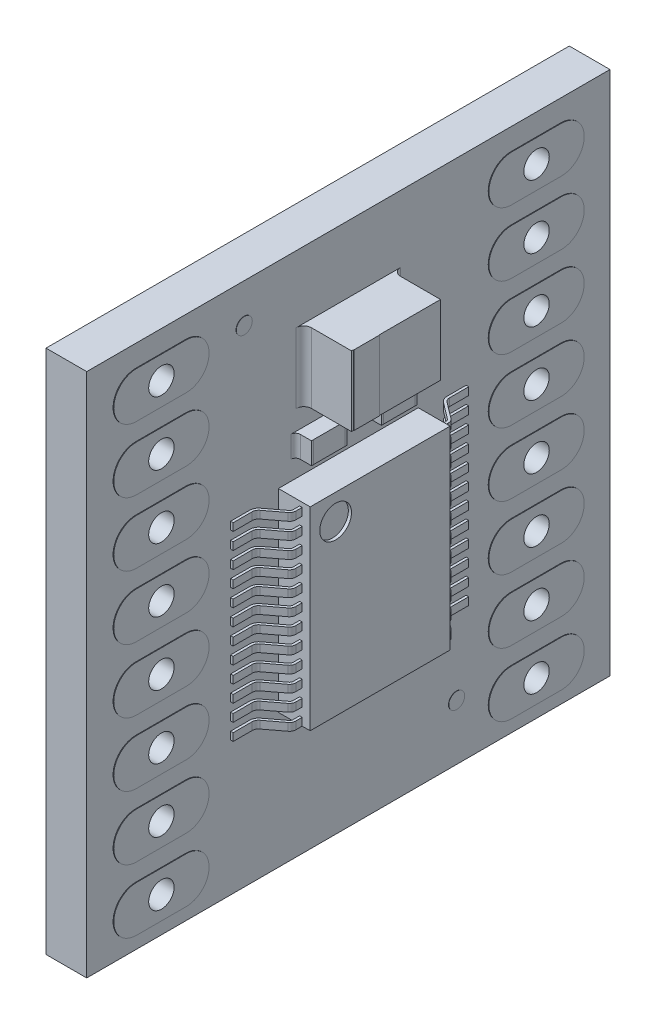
from build123d import *

# Parameters (mm, degrees)
SKETCH1_W            = 20.9042
SKETCH1_H            = 20.9804
BOSS_EXTRUDE1_DEPTH  = 1.6256
SKETCH2_W            = 5.588
SKETCH2_H            = 7.747
BOSS_EXTRUDE2_DEPTH  = 1.27
SKETCH7_R            = 0.635
CUT_EXTRUDE2_DEPTH   = 0.127
SKETCH4_R            = 0.508
CUT_EXTRUDE1_DEPTH   = 15.897424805
BOSS_EXTRUDE3_START  = 0.0254
SKETCH5_R            = 0.508
BOSS_EXTRUDE3_DEPTH  = 0.0254
SKETCH6_R            = 0.508
BOSS_EXTRUDE4_DEPTH  = 0.0254
LPATTERN1_COUNT      = 8
LPATTERN1_PITCH      = 2.54
SKETCH11_R           = 0.3175
BOSS_EXTRUDE8_DEPTH  = 0.0127
SKETCH9_W            = 1.27
SKETCH9_H            = 0.8636
BOSS_EXTRUDE6_DEPTH  = 0.635
SKETCH10_W           = 0.0762
SKETCH10_H           = 0.8636
BOSS_EXTRUDE7_DEPTH  = 0.63627
FILLET1_R            = 0.1905
SKETCH12_W           = 3.556
SKETCH12_H           = 2.794
BOSS_EXTRUDE9_DEPTH  = 1.905
FILLET2_R            = 0.3048
SKETCH13_W           = 1.016
SKETCH13_H           = 2.794
BOSS_EXTRUDE10_DEPTH = 0.0127
BOSS_EXTRUDE11_DEPTH = 0.3048
LPATTERN2_COUNT      = 12
LPATTERN2_PITCH      = 0.6604


with BuildPart() as part:
    # Sketch1 → Boss-Extrude1 (new body)
    with BuildSketch(Plane(origin=(0, 0, 0), x_dir=(0, 0, -1), z_dir=(1, 0, 0))):
        Rectangle(SKETCH1_W, SKETCH1_H)
    extrude(amount=BOSS_EXTRUDE1_DEPTH)

    # Sketch2 → Boss-Extrude2 (add)
    with BuildSketch(Plane(origin=(1.6256, 0, 0), x_dir=(0, 0, -1), z_dir=(1, 0, 0))):
        with Locations((0, -1.2573)):
            Rectangle(SKETCH2_W, SKETCH2_H)
    extrude(amount=BOSS_EXTRUDE2_DEPTH)

    # Sketch7 → Cut-Extrude2 (cut)
    with BuildSketch(Plane(origin=(2.8956, 0, 0), x_dir=(0, 0, -1), z_dir=(1, 0, 0))):
        with Locations((-1.778, 1.6002)):
            Circle(SKETCH7_R)
    extrude(amount=-CUT_EXTRUDE2_DEPTH, mode=Mode.SUBTRACT)

    # Sketch4 → Cut-Extrude1 (cut, through all)
    with BuildSketch(Plane(origin=(1.6256, 0, 0), x_dir=(0, 0, -1), z_dir=(1, 0, 0))):
        with Locations((-7.493, 8.7122)):
            Circle(SKETCH4_R)
        with Locations((7.493, 8.7122)):
            Circle(SKETCH4_R)
    cut_extrude1 = extrude(amount=-CUT_EXTRUDE1_DEPTH, mode=Mode.SUBTRACT)

    # Sketch5 → Boss-Extrude3 (add)
    # profile 1 of 2: a face of its own
    with BuildSketch(Plane(origin=(1.6256, 0, 0), x_dir=(0, 0, -1), z_dir=(1, 0, 0)).offset(BOSS_EXTRUDE3_START)):
        with BuildLine():
            Line((-8.4836, 9.6266), (-6.5024, 9.6266))
            ThreePointArc((-6.5024, 9.6266), (-5.588, 8.7122), (-6.5024, 7.7978))
            Line((-6.5024, 7.7978), (-8.4836, 7.7978))
            ThreePointArc((-8.4836, 7.7978), (-9.398, 8.7122), (-8.4836, 9.6266))
        make_face()
        with Locations((-7.493, 8.7122)):
            Circle(SKETCH5_R, mode=Mode.SUBTRACT)
    # profile 2 of 2: a face of its own
    with BuildSketch(Plane(origin=(1.6256, 0, 0), x_dir=(0, 0, -1), z_dir=(1, 0, 0)).offset(BOSS_EXTRUDE3_START)):
        with BuildLine():
            Line((6.5024, 9.6266), (8.4836, 9.6266))
            ThreePointArc((8.4836, 9.6266), (9.398, 8.7122), (8.4836, 7.7978))
            Line((8.4836, 7.7978), (6.5024, 7.7978))
            ThreePointArc((6.5024, 7.7978), (5.588, 8.7122), (6.5024, 9.6266))
        make_face()
        with Locations((7.493, 8.7122)):
            Circle(SKETCH5_R, mode=Mode.SUBTRACT)
    boss_extrude3 = extrude(amount=-BOSS_EXTRUDE3_DEPTH)

    # Sketch6 → Boss-Extrude4 (add)
    # profile 1 of 2: a face of its own
    with BuildSketch(Plane.ZY):
        with BuildLine():
            Line((-6.5024, 7.7978), (-8.4836, 7.7978))
            ThreePointArc((-8.4836, 7.7978), (-9.398, 8.7122), (-8.4836, 9.6266))
            Line((-8.4836, 9.6266), (-6.5024, 9.6266))
            ThreePointArc((-6.5024, 9.6266), (-5.588, 8.7122), (-6.5024, 7.7978))
        make_face()
        with Locations(Location((-7.493, 8.7122, 0), (0, 0, 180))):
            Circle(SKETCH6_R, mode=Mode.SUBTRACT)
    # profile 2 of 2: a face of its own
    with BuildSketch(Plane.ZY):
        with BuildLine():
            Line((8.4836, 7.7978), (6.5024, 7.7978))
            ThreePointArc((6.5024, 7.7978), (5.588, 8.7122), (6.5024, 9.6266))
            Line((6.5024, 9.6266), (8.4836, 9.6266))
            ThreePointArc((8.4836, 9.6266), (9.398, 8.7122), (8.4836, 7.7978))
        make_face()
        with Locations(Location((7.493, 8.7122, 0), (0, 0, 180))):
            Circle(SKETCH6_R, mode=Mode.SUBTRACT)
    boss_extrude4 = extrude(amount=BOSS_EXTRUDE4_DEPTH)

    # LPattern1: Cut-Extrude1, Boss-Extrude3, Boss-Extrude4 ×8
    with Locations(*[(0, -i * LPATTERN1_PITCH, 0) for i in range(1, LPATTERN1_COUNT)]):
        add(cut_extrude1, mode=Mode.SUBTRACT)
        add(boss_extrude3)
        add(boss_extrude4)

    # Sketch11 → Boss-Extrude8 (add)
    with BuildSketch(Plane(origin=(1.6256, 0, 0), x_dir=(0, 0, -1), z_dir=(1, 0, 0))):
        with Locations((-4.168295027, 8.945348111)):
            Circle(SKETCH11_R)
        with Locations((4.318468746, -8.263464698)):
            Circle(SKETCH11_R)
    extrude(amount=BOSS_EXTRUDE8_DEPTH)

    # Sketch9 → Boss-Extrude6 (add)
    with BuildSketch(Plane(origin=(1.6256, 0, 0), x_dir=(0, 0, -1), z_dir=(1, 0, 0))):
        with Locations((-1.397, 3.81)):
            Rectangle(SKETCH9_W, SKETCH9_H)
        with Locations((1.397, 3.81)):
            Rectangle(SKETCH9_W, SKETCH9_H)
    extrude(amount=BOSS_EXTRUDE6_DEPTH)

    # Sketch10 → Boss-Extrude7 (add)
    with BuildSketch(Plane(origin=(1.6256, 0, 0), x_dir=(0, 0, -1), z_dir=(1, 0, 0))):
        with Locations((-0.7239, 3.81)):
            Rectangle(SKETCH10_W, SKETCH10_H)
        with Locations((-2.0701, 3.81)):
            Rectangle(SKETCH10_W, SKETCH10_H)
        with Locations((0.7239, 3.81)):
            Rectangle(SKETCH10_W, SKETCH10_H)
        with Locations((2.0701, 3.81)):
            Rectangle(SKETCH10_W, SKETCH10_H)
    extrude(amount=BOSS_EXTRUDE7_DEPTH)

    # Fillet1
    fillet1_edges = [part.edges().sort_by_distance(p)[0] for p in [
        (1.6256, 3.81, 0.6858),
        (1.6256, 3.81, 2.1082),
        (1.6256, 3.81, -0.6858),
        (1.6256, 3.81, -2.1082),
    ]]
    fillet(fillet1_edges, radius=FILLET1_R)

    # Sketch12 → Boss-Extrude9 (add)
    with BuildSketch(Plane(origin=(1.6256, 0, 0), x_dir=(0, 0, -1), z_dir=(1, 0, 0))):
        with Locations((0, 6.4262)):
            Rectangle(SKETCH12_W, SKETCH12_H)
    extrude(amount=BOSS_EXTRUDE9_DEPTH)

    # Fillet2
    fillet2_edges = [part.edges().sort_by_distance(p)[0] for p in [
        (1.6256, 6.4262, -1.778),
        (1.6256, 6.4262, 1.778),
    ]]
    fillet(fillet2_edges, radius=FILLET2_R)

    # Sketch13 → Boss-Extrude10 (add)
    with BuildSketch(Plane(origin=(3.5306, 0, 0), x_dir=(0, 0, -1), z_dir=(1, 0, 0))):
        with Locations((-1.187840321, 6.4262)):
            Rectangle(SKETCH13_W, SKETCH13_H)
    extrude(amount=BOSS_EXTRUDE10_DEPTH)

    # Sketch14 → Boss-Extrude11 (add)
    with BuildSketch(Plane.XZ.offset(5.1308)):
        with BuildLine():
            Line((2.574515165, -2.794), (2.574515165, -3.048))
            ThreePointArc((2.574515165, -3.048), (2.547978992, -3.161031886), (2.473915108, -3.250446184))
            Line((2.473915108, -3.250446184), (1.827800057, -3.740028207))
            ThreePointArc((1.827800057, -3.740028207), (1.753736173, -3.829442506), (1.7272, -3.942474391))
            Line((1.7272, -3.942474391), (1.7272, -4.704474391))
            Line((1.7272, -4.704474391), (1.6256, -4.704474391))
            Line((1.6256, -4.704474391), (1.6256, -3.942474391))
            ThreePointArc((1.6256, -3.942474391), (1.662750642, -3.784229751), (1.766440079, -3.659049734))
            Line((1.766440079, -3.659049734), (2.412555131, -3.16946771))
            ThreePointArc((2.412555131, -3.16946771), (2.456993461, -3.115819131), (2.472915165, -3.048))
            Line((2.472915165, -3.048), (2.472915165, -2.794))
            Line((2.472915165, -2.794), (2.574515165, -2.794))
        make_face()
        with BuildLine():
            Line((2.574515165, 2.794), (2.472915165, 2.794))
            Line((2.472915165, 2.794), (2.472915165, 3.048))
            ThreePointArc((2.472915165, 3.048), (2.456993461, 3.115819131), (2.412555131, 3.16946771))
            Line((2.412555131, 3.16946771), (1.766440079, 3.659049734))
            ThreePointArc((1.766440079, 3.659049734), (1.662750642, 3.784229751), (1.6256, 3.942474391))
            Line((1.6256, 3.942474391), (1.6256, 4.704474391))
            Line((1.6256, 4.704474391), (1.7272, 4.704474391))
            Line((1.7272, 4.704474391), (1.7272, 3.942474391))
            ThreePointArc((1.7272, 3.942474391), (1.753736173, 3.829442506), (1.827800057, 3.740028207))
            Line((1.827800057, 3.740028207), (2.473915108, 3.250446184))
            ThreePointArc((2.473915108, 3.250446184), (2.547978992, 3.161031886), (2.574515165, 3.048))
            Line((2.574515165, 3.048), (2.574515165, 2.794))
        make_face()
    boss_extrude11 = extrude(amount=-BOSS_EXTRUDE11_DEPTH)

    # LPattern2: Boss-Extrude11 ×12
    with Locations(*[(0, i * LPATTERN2_PITCH, 0) for i in range(1, LPATTERN2_COUNT)]):
        add(boss_extrude11)


solid = part.part
